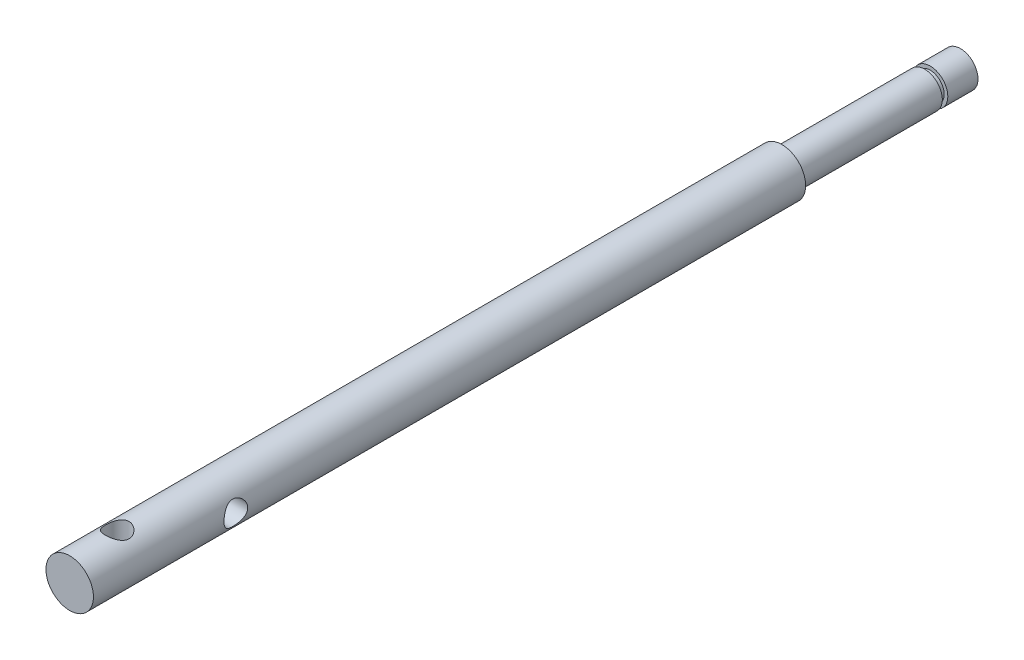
ISO-10303-21;
HEADER;
FILE_DESCRIPTION(('STEP AP214'),'2;1');
FILE_NAME('part.step','',(''),(''),'','','');
FILE_SCHEMA(('AUTOMOTIVE_DESIGN { 1 0 10303 214 1 1 1 1 }'));
ENDSEC;
DATA;
#1=APPLICATION_CONTEXT('core data for automotive mechanical design processes');
#2=APPLICATION_PROTOCOL_DEFINITION('international standard','automotive_design',2000,#1);
#3=PRODUCT_CONTEXT('',#1,'mechanical');
#4=PRODUCT('Part','Part','',(#3));
#5=PRODUCT_RELATED_PRODUCT_CATEGORY('part','',(#4));
#6=PRODUCT_DEFINITION_FORMATION('','',#4);
#7=PRODUCT_DEFINITION_CONTEXT('part definition',#1,'design');
#8=PRODUCT_DEFINITION('design','',#6,#7);
#9=PRODUCT_DEFINITION_SHAPE('','',#8);
#10=(LENGTH_UNIT() NAMED_UNIT(*) SI_UNIT(.MILLI.,.METRE.));
#11=(NAMED_UNIT(*) PLANE_ANGLE_UNIT() SI_UNIT($,.RADIAN.));
#12=(NAMED_UNIT(*) SI_UNIT($,.STERADIAN.) SOLID_ANGLE_UNIT());
#13=UNCERTAINTY_MEASURE_WITH_UNIT(LENGTH_MEASURE(1.E-05),#10,'distance_accuracy_value','');
#14=(GEOMETRIC_REPRESENTATION_CONTEXT(3) GLOBAL_UNCERTAINTY_ASSIGNED_CONTEXT((#13)) GLOBAL_UNIT_ASSIGNED_CONTEXT((#10,
#11,#12)) REPRESENTATION_CONTEXT('',''));
#15=CARTESIAN_POINT('',(0.,0.,0.));
#16=DIRECTION('',(0.,0.,1.));
#17=DIRECTION('',(1.,0.,0.));
#18=AXIS2_PLACEMENT_3D('',#15,#16,#17);
#19=CARTESIAN_POINT('',(0.,0.,23.876));
#20=DIRECTION('',(0.,0.,-1.));
#21=DIRECTION('',(-1.,0.,0.));
#22=AXIS2_PLACEMENT_3D('',#19,#20,#21);
#23=CYLINDRICAL_SURFACE('',#22,2.3495);
#24=CARTESIAN_POINT('',(0.,0.,0.));
#25=DIRECTION('',(0.,0.,1.));
#26=DIRECTION('',(1.,0.,0.));
#27=AXIS2_PLACEMENT_3D('',#24,#25,#26);
#28=CIRCLE('',#27,2.3495);
#29=CARTESIAN_POINT('',(2.3495,0.,0.));
#30=VERTEX_POINT('',#29);
#31=EDGE_CURVE('E45',#30,#30,#28,.T.);
#32=ORIENTED_EDGE('',*,*,#31,.T.);
#33=EDGE_LOOP('',(#32));
#34=FACE_BOUND('',#33,.T.);
#35=CARTESIAN_POINT('',(0.,0.,4.0386));
#36=DIRECTION('',(0.,0.,1.));
#37=DIRECTION('',(1.,0.,0.));
#38=AXIS2_PLACEMENT_3D('',#35,#36,#37);
#39=CIRCLE('',#38,2.3495);
#40=CARTESIAN_POINT('',(2.3495,0.,4.0386));
#41=VERTEX_POINT('',#40);
#42=EDGE_CURVE('E50',#41,#41,#39,.T.);
#43=ORIENTED_EDGE('',*,*,#42,.F.);
#44=EDGE_LOOP('',(#43));
#45=FACE_BOUND('',#44,.T.);
#46=ADVANCED_FACE('F34',(#34,#45),#23,.T.);
#47=CARTESIAN_POINT('',(0.,0.,0.));
#48=DIRECTION('',(0.,0.,1.));
#49=DIRECTION('',(1.,0.,0.));
#50=AXIS2_PLACEMENT_3D('',#47,#48,#49);
#51=PLANE('',#50);
#52=ORIENTED_EDGE('',*,*,#31,.F.);
#53=EDGE_LOOP('',(#52));
#54=FACE_BOUND('',#53,.T.);
#55=ADVANCED_FACE('F98',(#54),#51,.F.);
#56=CARTESIAN_POINT('',(0.,2.68096212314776,4.0386));
#57=DIRECTION('',(0.,0.,1.));
#58=DIRECTION('',(1.,0.,0.));
#59=AXIS2_PLACEMENT_3D('',#56,#57,#58);
#60=PLANE('',#59);
#61=CARTESIAN_POINT('',(0.,0.,4.0386));
#62=DIRECTION('',(0.,0.,-1.));
#63=DIRECTION('',(-1.,0.,0.));
#64=AXIS2_PLACEMENT_3D('',#61,#62,#63);
#65=CIRCLE('',#64,1.8669);
#66=CARTESIAN_POINT('',(-1.8669,0.,4.0386));
#67=VERTEX_POINT('',#66);
#68=EDGE_CURVE('E53',#67,#67,#65,.T.);
#69=ORIENTED_EDGE('',*,*,#68,.T.);
#70=EDGE_LOOP('',(#69));
#71=FACE_BOUND('',#70,.T.);
#72=ORIENTED_EDGE('',*,*,#42,.T.);
#73=EDGE_LOOP('',(#72));
#74=FACE_BOUND('',#73,.T.);
#75=ADVANCED_FACE('F103',(#71,#74),#60,.T.);
#76=CARTESIAN_POINT('',(0.,1.8669,4.7752));
#77=DIRECTION('',(0.,0.,-1.));
#78=DIRECTION('',(-1.,0.,0.));
#79=AXIS2_PLACEMENT_3D('',#76,#77,#78);
#80=PLANE('',#79);
#81=CARTESIAN_POINT('',(0.,0.,4.7752));
#82=DIRECTION('',(0.,0.,-1.));
#83=DIRECTION('',(-1.,0.,0.));
#84=AXIS2_PLACEMENT_3D('',#81,#82,#83);
#85=CIRCLE('',#84,1.8669);
#86=CARTESIAN_POINT('',(-1.8669,0.,4.7752));
#87=VERTEX_POINT('',#86);
#88=EDGE_CURVE('E127',#87,#87,#85,.T.);
#89=ORIENTED_EDGE('',*,*,#88,.F.);
#90=EDGE_LOOP('',(#89));
#91=FACE_BOUND('',#90,.T.);
#92=CARTESIAN_POINT('',(0.,0.,4.7752));
#93=DIRECTION('',(0.,0.,-1.));
#94=DIRECTION('',(-1.,0.,0.));
#95=AXIS2_PLACEMENT_3D('',#92,#93,#94);
#96=CIRCLE('',#95,2.3495);
#97=CARTESIAN_POINT('',(-2.3495,0.,4.7752));
#98=VERTEX_POINT('',#97);
#99=EDGE_CURVE('E56',#98,#98,#96,.T.);
#100=ORIENTED_EDGE('',*,*,#99,.T.);
#101=EDGE_LOOP('',(#100));
#102=FACE_BOUND('',#101,.T.);
#103=ADVANCED_FACE('F110',(#91,#102),#80,.T.);
#104=CARTESIAN_POINT('',(0.,0.,0.));
#105=DIRECTION('',(0.,0.,-1.));
#106=DIRECTION('',(-1.,0.,0.));
#107=AXIS2_PLACEMENT_3D('',#104,#105,#106);
#108=CYLINDRICAL_SURFACE('',#107,1.8669);
#109=ORIENTED_EDGE('',*,*,#68,.F.);
#110=EDGE_LOOP('',(#109));
#111=FACE_BOUND('',#110,.T.);
#112=ORIENTED_EDGE('',*,*,#88,.T.);
#113=EDGE_LOOP('',(#112));
#114=FACE_BOUND('',#113,.T.);
#115=ADVANCED_FACE('F94',(#111,#114),#108,.T.);
#116=CARTESIAN_POINT('',(0.,0.,23.876));
#117=DIRECTION('',(0.,0.,1.));
#118=DIRECTION('',(1.,0.,0.));
#119=AXIS2_PLACEMENT_3D('',#116,#117,#118);
#120=CIRCLE('',#119,2.3495);
#121=CARTESIAN_POINT('',(2.3495,0.,23.876));
#122=VERTEX_POINT('',#121);
#123=EDGE_CURVE('E10',#122,#122,#120,.T.);
#124=ORIENTED_EDGE('',*,*,#123,.F.);
#125=EDGE_LOOP('',(#124));
#126=FACE_BOUND('',#125,.T.);
#127=ORIENTED_EDGE('',*,*,#99,.F.);
#128=EDGE_LOOP('',(#127));
#129=FACE_BOUND('',#128,.T.);
#130=ADVANCED_FACE('F87',(#126,#129),#23,.T.);
#131=CARTESIAN_POINT('',(0.,0.,23.876));
#132=DIRECTION('',(0.,0.,1.));
#133=DIRECTION('',(1.,0.,0.));
#134=AXIS2_PLACEMENT_3D('',#131,#132,#133);
#135=PLANE('',#134);
#136=CARTESIAN_POINT('',(0.,0.,23.876));
#137=DIRECTION('',(0.,0.,1.));
#138=DIRECTION('',(1.,0.,0.));
#139=AXIS2_PLACEMENT_3D('',#136,#137,#138);
#140=CIRCLE('',#139,3.175);
#141=CARTESIAN_POINT('',(3.175,0.,23.876));
#142=VERTEX_POINT('',#141);
#143=EDGE_CURVE('E130',#142,#142,#140,.T.);
#144=ORIENTED_EDGE('',*,*,#143,.F.);
#145=EDGE_LOOP('',(#144));
#146=FACE_BOUND('',#145,.T.);
#147=ORIENTED_EDGE('',*,*,#123,.T.);
#148=EDGE_LOOP('',(#147));
#149=FACE_BOUND('',#148,.T.);
#150=ADVANCED_FACE('F85',(#146,#149),#135,.F.);
#151=CARTESIAN_POINT('',(0.,0.,119.126));
#152=DIRECTION('',(0.,0.,-1.));
#153=DIRECTION('',(-1.,0.,0.));
#154=AXIS2_PLACEMENT_3D('',#151,#152,#153);
#155=CYLINDRICAL_SURFACE('',#154,3.175);
#156=CARTESIAN_POINT('',(-3.175,0.,101.6635));
#157=CARTESIAN_POINT('',(-3.17499545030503,-0.0834579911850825,101.663494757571));
#158=CARTESIAN_POINT('',(-3.17167404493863,-0.167015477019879,101.65688000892));
#159=CARTESIAN_POINT('',(-3.15871472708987,-0.33166087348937,101.630713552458));
#160=CARTESIAN_POINT('',(-3.1490648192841,-0.412743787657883,101.611137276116));
#161=CARTESIAN_POINT('',(-3.12445843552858,-0.569807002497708,101.560004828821));
#162=CARTESIAN_POINT('',(-3.10952259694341,-0.64580579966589,101.528495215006));
#163=CARTESIAN_POINT('',(-3.07571420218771,-0.79132527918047,101.454631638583));
#164=CARTESIAN_POINT('',(-3.05684195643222,-0.860846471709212,101.412278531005));
#165=CARTESIAN_POINT('',(-3.01555559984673,-0.996168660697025,101.315016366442));
#166=CARTESIAN_POINT('',(-2.99299628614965,-1.06149014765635,101.259502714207));
#167=CARTESIAN_POINT('',(-2.94735202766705,-1.18233736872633,101.138797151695));
#168=CARTESIAN_POINT('',(-2.92426669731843,-1.23785563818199,101.073597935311));
#169=CARTESIAN_POINT('',(-2.87812085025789,-1.34183755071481,100.929307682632));
#170=CARTESIAN_POINT('',(-2.85520109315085,-1.38942022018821,100.849531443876));
#171=CARTESIAN_POINT('',(-2.81441491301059,-1.47029206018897,100.681841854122));
#172=CARTESIAN_POINT('',(-2.79654488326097,-1.50359144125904,100.593934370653));
#173=CARTESIAN_POINT('',(-2.76951863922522,-1.55278525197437,100.417844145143));
#174=CARTESIAN_POINT('',(-2.75990481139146,-1.56960229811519,100.329992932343));
#175=CARTESIAN_POINT('',(-2.74926250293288,-1.58817785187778,100.152233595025));
#176=CARTESIAN_POINT('',(-2.74822553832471,-1.58995124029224,100.062327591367));
#177=CARTESIAN_POINT('',(-2.75448601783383,-1.579066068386,99.8945709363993));
#178=CARTESIAN_POINT('',(-2.76080162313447,-1.56810798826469,99.8165643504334));
#179=CARTESIAN_POINT('',(-2.77933513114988,-1.53501701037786,99.6636914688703));
#180=CARTESIAN_POINT('',(-2.79155491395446,-1.5128805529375,99.5888261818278));
#181=CARTESIAN_POINT('',(-2.82078868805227,-1.45765802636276,99.442223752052));
#182=CARTESIAN_POINT('',(-2.83790772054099,-1.42432891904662,99.3706000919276));
#183=CARTESIAN_POINT('',(-2.87501654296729,-1.34785367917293,99.2336180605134));
#184=CARTESIAN_POINT('',(-2.89500762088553,-1.30470313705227,99.1682625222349));
#185=CARTESIAN_POINT('',(-2.93867138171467,-1.20342986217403,99.0369475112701));
#186=CARTESIAN_POINT('',(-2.96248947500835,-1.14410245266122,98.9719622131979));
#187=CARTESIAN_POINT('',(-3.00906851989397,-1.01529448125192,98.852457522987));
#188=CARTESIAN_POINT('',(-3.03182896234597,-0.945809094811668,98.7979431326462));
#189=CARTESIAN_POINT('',(-3.07501904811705,-0.794569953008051,98.6985490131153));
#190=CARTESIAN_POINT('',(-3.09529137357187,-0.712396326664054,98.6542342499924));
#191=CARTESIAN_POINT('',(-3.12988136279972,-0.54049011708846,98.5804209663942));
#192=CARTESIAN_POINT('',(-3.14420375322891,-0.450763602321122,98.5509106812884));
#193=CARTESIAN_POINT('',(-3.16427379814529,-0.274266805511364,98.5099702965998));
#194=CARTESIAN_POINT('',(-3.1706333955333,-0.187867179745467,98.497245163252));
#195=CARTESIAN_POINT('',(-3.17615908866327,-0.0139376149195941,98.486174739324));
#196=CARTESIAN_POINT('',(-3.17532859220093,0.0735917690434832,98.4878226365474));
#197=CARTESIAN_POINT('',(-3.16692267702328,0.240082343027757,98.5047031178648));
#198=CARTESIAN_POINT('',(-3.15987502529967,0.319181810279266,98.5188728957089));
#199=CARTESIAN_POINT('',(-3.14042696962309,0.473720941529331,98.5587279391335));
#200=CARTESIAN_POINT('',(-3.12802597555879,0.549160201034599,98.5844144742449));
#201=CARTESIAN_POINT('',(-3.09854999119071,0.696735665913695,98.6472475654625));
#202=CARTESIAN_POINT('',(-3.08135149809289,0.768715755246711,98.6847007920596));
#203=CARTESIAN_POINT('',(-3.043935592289,0.905607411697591,98.7696582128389));
#204=CARTESIAN_POINT('',(-3.02371689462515,0.970515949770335,98.8171666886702));
#205=CARTESIAN_POINT('',(-2.97986801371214,1.09818120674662,98.9262696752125));
#206=CARTESIAN_POINT('',(-2.95609779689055,1.1601006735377,98.9887893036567));
#207=CARTESIAN_POINT('',(-2.90929046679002,1.27294690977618,99.1233811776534));
#208=CARTESIAN_POINT('',(-2.88625386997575,1.32386607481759,99.1954599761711));
#209=CARTESIAN_POINT('',(-2.84243767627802,1.41558631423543,99.3515343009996));
#210=CARTESIAN_POINT('',(-2.82182140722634,1.45577797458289,99.435937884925));
#211=CARTESIAN_POINT('',(-2.7872383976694,1.52095648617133,99.6116722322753));
#212=CARTESIAN_POINT('',(-2.77326309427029,1.54596292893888,99.7029938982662));
#213=CARTESIAN_POINT('',(-2.75528882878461,1.57775542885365,99.8805949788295));
#214=CARTESIAN_POINT('',(-2.75046096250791,1.58606013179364,99.9665168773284));
#215=CARTESIAN_POINT('',(-2.74900000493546,1.58859403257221,100.138622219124));
#216=CARTESIAN_POINT('',(-2.75236336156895,1.58282933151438,100.224805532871));
#217=CARTESIAN_POINT('',(-2.76602606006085,1.55880772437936,100.386330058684));
#218=CARTESIAN_POINT('',(-2.77563412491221,1.54179319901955,100.461921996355));
#219=CARTESIAN_POINT('',(-2.79988988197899,1.49729088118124,100.609095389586));
#220=CARTESIAN_POINT('',(-2.8145391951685,1.46979971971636,100.680675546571));
#221=CARTESIAN_POINT('',(-2.84842791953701,1.40305749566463,100.823116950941));
#222=CARTESIAN_POINT('',(-2.86790959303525,1.36314043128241,100.893606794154));
#223=CARTESIAN_POINT('',(-2.90886088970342,1.27341466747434,101.027348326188));
#224=CARTESIAN_POINT('',(-2.93033154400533,1.22360082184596,101.090596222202));
#225=CARTESIAN_POINT('',(-2.97596438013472,1.10839778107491,101.216050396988));
#226=CARTESIAN_POINT('',(-3.00013660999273,1.04185152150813,101.277196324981));
#227=CARTESIAN_POINT('',(-3.0460593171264,0.898770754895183,101.387692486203));
#228=CARTESIAN_POINT('',(-3.06780848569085,0.822230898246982,101.437036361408));
#229=CARTESIAN_POINT('',(-3.10670590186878,0.660291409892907,101.522587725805));
#230=CARTESIAN_POINT('',(-3.12382053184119,0.574832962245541,101.558699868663));
#231=CARTESIAN_POINT('',(-3.15120879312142,0.398053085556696,101.615570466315));
#232=CARTESIAN_POINT('',(-3.1615018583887,0.306749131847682,101.636372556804));
#233=CARTESIAN_POINT('',(-3.17016545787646,0.178755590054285,101.653812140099));
#234=CARTESIAN_POINT('',(-3.17197367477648,0.143131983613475,101.657439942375));
#235=CARTESIAN_POINT('',(-3.17439193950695,0.0716783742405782,101.662285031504));
#236=CARTESIAN_POINT('',(-3.17500195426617,0.0358483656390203,101.663502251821));
#237=CARTESIAN_POINT('',(-3.175,0.,101.6635));
#238=B_SPLINE_CURVE_WITH_KNOTS('',3,(#156,#157,#158,#159,#160,#161,#162,#163,#164,#165,#166,
#167,#168,#169,#170,#171,#172,#173,#174,#175,#176,#177,#178,#179,#180,#181,#182,#183,#184,#185,
#186,#187,#188,#189,#190,#191,#192,#193,#194,#195,#196,#197,#198,#199,#200,#201,#202,#203,#204,
#205,#206,#207,#208,#209,#210,#211,#212,#213,#214,#215,#216,#217,#218,#219,#220,#221,#222,#223,
#224,#225,#226,#227,#228,#229,#230,#231,#232,#233,#234,#235,#236,#237),.UNSPECIFIED.,.T.,.F.,(4,
2,2,2,2,2,2,2,2,2,2,2,2,2,2,2,2,2,2,2,2,2,2,2,2,2,2,2,2,2,2,2,2,2,2,2,2,2,2,2,4),(0.,
0.250228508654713,0.500932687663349,0.750668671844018,1.00038496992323,1.26520854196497,
1.53023290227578,1.81580990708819,2.10118242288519,2.36947094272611,2.63749404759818,
2.87346568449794,3.10951251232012,3.35105756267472,3.59271127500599,3.86500594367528,
4.1374303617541,4.4225054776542,4.70735369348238,4.96860973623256,5.22974196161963,
5.47063464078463,5.71155388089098,5.95936158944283,6.20727503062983,6.47953381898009,
6.75198021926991,7.03762057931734,7.32289162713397,7.58077775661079,7.83855207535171,
8.07176964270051,8.30506226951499,8.55402875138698,8.80312503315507,9.08248822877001,
9.36200158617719,9.64349121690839,9.92417542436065,10.0316550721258,10.1391376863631),.UNSPECIFIED.);
#239=CARTESIAN_POINT('',(-3.175,0.,101.6635));
#240=VERTEX_POINT('',#239);
#241=EDGE_CURVE('E37',#240,#240,#238,.T.);
#242=ORIENTED_EDGE('',*,*,#241,.T.);
#243=EDGE_LOOP('',(#242));
#244=FACE_BOUND('',#243,.T.);
#245=CARTESIAN_POINT('',(3.175,0.,98.4885));
#246=CARTESIAN_POINT('',(3.17499545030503,-0.0834579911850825,98.4885052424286));
#247=CARTESIAN_POINT('',(3.17167404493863,-0.167015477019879,98.4951199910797));
#248=CARTESIAN_POINT('',(3.15871472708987,-0.33166087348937,98.5212864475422));
#249=CARTESIAN_POINT('',(3.1490648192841,-0.412743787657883,98.5408627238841));
#250=CARTESIAN_POINT('',(3.12445843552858,-0.569807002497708,98.5919951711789));
#251=CARTESIAN_POINT('',(3.10952259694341,-0.64580579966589,98.6235047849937));
#252=CARTESIAN_POINT('',(3.07571420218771,-0.79132527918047,98.6973683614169));
#253=CARTESIAN_POINT('',(3.05684195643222,-0.860846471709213,98.7397214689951));
#254=CARTESIAN_POINT('',(3.01555559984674,-0.996168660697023,98.8369836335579));
#255=CARTESIAN_POINT('',(2.99299628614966,-1.06149014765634,98.8924972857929));
#256=CARTESIAN_POINT('',(2.94735202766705,-1.18233736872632,99.0132028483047));
#257=CARTESIAN_POINT('',(2.92426669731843,-1.23785563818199,99.0784020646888));
#258=CARTESIAN_POINT('',(2.87812085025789,-1.34183755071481,99.2226923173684));
#259=CARTESIAN_POINT('',(2.85520109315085,-1.38942022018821,99.3024685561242));
#260=CARTESIAN_POINT('',(2.81441491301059,-1.47029206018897,99.4701581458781));
#261=CARTESIAN_POINT('',(2.79654488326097,-1.50359144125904,99.5580656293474));
#262=CARTESIAN_POINT('',(2.76951863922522,-1.55278525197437,99.7341558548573));
#263=CARTESIAN_POINT('',(2.75990481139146,-1.56960229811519,99.822007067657));
#264=CARTESIAN_POINT('',(2.74926250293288,-1.58817785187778,99.9997664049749));
#265=CARTESIAN_POINT('',(2.74822553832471,-1.58995124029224,100.089672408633));
#266=CARTESIAN_POINT('',(2.75448601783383,-1.579066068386,100.257429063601));
#267=CARTESIAN_POINT('',(2.76080162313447,-1.56810798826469,100.335435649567));
#268=CARTESIAN_POINT('',(2.77933513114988,-1.53501701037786,100.48830853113));
#269=CARTESIAN_POINT('',(2.79155491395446,-1.5128805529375,100.563173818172));
#270=CARTESIAN_POINT('',(2.82078868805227,-1.45765802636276,100.709776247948));
#271=CARTESIAN_POINT('',(2.83790772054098,-1.42432891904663,100.781399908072));
#272=CARTESIAN_POINT('',(2.87501654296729,-1.34785367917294,100.918381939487));
#273=CARTESIAN_POINT('',(2.89500762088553,-1.30470313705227,100.983737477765));
#274=CARTESIAN_POINT('',(2.93867138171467,-1.20342986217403,101.11505248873));
#275=CARTESIAN_POINT('',(2.96248947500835,-1.14410245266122,101.180037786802));
#276=CARTESIAN_POINT('',(3.00906851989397,-1.01529448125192,101.299542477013));
#277=CARTESIAN_POINT('',(3.03182896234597,-0.945809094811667,101.354056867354));
#278=CARTESIAN_POINT('',(3.07501904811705,-0.794569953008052,101.453450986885));
#279=CARTESIAN_POINT('',(3.09529137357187,-0.712396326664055,101.497765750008));
#280=CARTESIAN_POINT('',(3.12988136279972,-0.540490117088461,101.571579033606));
#281=CARTESIAN_POINT('',(3.14420375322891,-0.450763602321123,101.601089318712));
#282=CARTESIAN_POINT('',(3.16427379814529,-0.274266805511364,101.6420297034));
#283=CARTESIAN_POINT('',(3.1706333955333,-0.187867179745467,101.654754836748));
#284=CARTESIAN_POINT('',(3.17615908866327,-0.0139376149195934,101.665825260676));
#285=CARTESIAN_POINT('',(3.17532859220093,0.0735917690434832,101.664177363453));
#286=CARTESIAN_POINT('',(3.16692267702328,0.240082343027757,101.647296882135));
#287=CARTESIAN_POINT('',(3.15987502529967,0.319181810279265,101.633127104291));
#288=CARTESIAN_POINT('',(3.14042696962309,0.473720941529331,101.593272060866));
#289=CARTESIAN_POINT('',(3.12802597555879,0.549160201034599,101.567585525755));
#290=CARTESIAN_POINT('',(3.09854999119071,0.696735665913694,101.504752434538));
#291=CARTESIAN_POINT('',(3.08135149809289,0.768715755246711,101.46729920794));
#292=CARTESIAN_POINT('',(3.04393559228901,0.905607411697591,101.382341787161));
#293=CARTESIAN_POINT('',(3.02371689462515,0.970515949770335,101.33483331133));
#294=CARTESIAN_POINT('',(2.97986801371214,1.09818120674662,101.225730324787));
#295=CARTESIAN_POINT('',(2.95609779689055,1.1601006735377,101.163210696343));
#296=CARTESIAN_POINT('',(2.90929046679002,1.27294690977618,101.028618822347));
#297=CARTESIAN_POINT('',(2.88625386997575,1.32386607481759,100.956540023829));
#298=CARTESIAN_POINT('',(2.84243767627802,1.41558631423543,100.800465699));
#299=CARTESIAN_POINT('',(2.82182140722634,1.45577797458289,100.716062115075));
#300=CARTESIAN_POINT('',(2.7872383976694,1.52095648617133,100.540327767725));
#301=CARTESIAN_POINT('',(2.77326309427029,1.54596292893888,100.449006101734));
#302=CARTESIAN_POINT('',(2.75528882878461,1.57775542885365,100.271405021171));
#303=CARTESIAN_POINT('',(2.75046096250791,1.58606013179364,100.185483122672));
#304=CARTESIAN_POINT('',(2.74900000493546,1.58859403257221,100.013377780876));
#305=CARTESIAN_POINT('',(2.75236336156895,1.58282933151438,99.9271944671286));
#306=CARTESIAN_POINT('',(2.76602606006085,1.55880772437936,99.7656699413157));
#307=CARTESIAN_POINT('',(2.77563412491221,1.54179319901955,99.6900780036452));
#308=CARTESIAN_POINT('',(2.79988988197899,1.49729088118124,99.5429046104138));
#309=CARTESIAN_POINT('',(2.81453919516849,1.46979971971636,99.4713244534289));
#310=CARTESIAN_POINT('',(2.84842791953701,1.40305749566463,99.3288830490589));
#311=CARTESIAN_POINT('',(2.86790959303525,1.36314043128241,99.2583932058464));
#312=CARTESIAN_POINT('',(2.90886088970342,1.27341466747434,99.1246516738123));
#313=CARTESIAN_POINT('',(2.93033154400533,1.22360082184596,99.0614037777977));
#314=CARTESIAN_POINT('',(2.97596438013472,1.10839778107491,98.9359496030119));
#315=CARTESIAN_POINT('',(3.00013660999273,1.04185152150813,98.8748036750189));
#316=CARTESIAN_POINT('',(3.0460593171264,0.898770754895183,98.7643075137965));
#317=CARTESIAN_POINT('',(3.06780848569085,0.822230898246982,98.7149636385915));
#318=CARTESIAN_POINT('',(3.10670590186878,0.660291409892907,98.6294122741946));
#319=CARTESIAN_POINT('',(3.12382053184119,0.574832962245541,98.5933001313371));
#320=CARTESIAN_POINT('',(3.15120879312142,0.398053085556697,98.5364295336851));
#321=CARTESIAN_POINT('',(3.1615018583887,0.306749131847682,98.5156274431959));
#322=CARTESIAN_POINT('',(3.17016545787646,0.178755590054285,98.4981878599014));
#323=CARTESIAN_POINT('',(3.17197367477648,0.143131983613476,98.4945600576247));
#324=CARTESIAN_POINT('',(3.17439193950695,0.0716783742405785,98.4897149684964));
#325=CARTESIAN_POINT('',(3.17500195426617,0.0358483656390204,98.4884977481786));
#326=CARTESIAN_POINT('',(3.175,0.,98.4885));
#327=B_SPLINE_CURVE_WITH_KNOTS('',3,(#245,#246,#247,#248,#249,#250,#251,#252,#253,#254,#255,
#256,#257,#258,#259,#260,#261,#262,#263,#264,#265,#266,#267,#268,#269,#270,#271,#272,#273,#274,
#275,#276,#277,#278,#279,#280,#281,#282,#283,#284,#285,#286,#287,#288,#289,#290,#291,#292,#293,
#294,#295,#296,#297,#298,#299,#300,#301,#302,#303,#304,#305,#306,#307,#308,#309,#310,#311,#312,
#313,#314,#315,#316,#317,#318,#319,#320,#321,#322,#323,#324,#325,#326),.UNSPECIFIED.,.T.,.F.,(4,
2,2,2,2,2,2,2,2,2,2,2,2,2,2,2,2,2,2,2,2,2,2,2,2,2,2,2,2,2,2,2,2,2,2,2,2,2,2,2,4),(0.,
0.250228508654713,0.500932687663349,0.750668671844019,1.00038496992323,1.26520854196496,
1.53023290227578,1.81580990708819,2.10118242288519,2.36947094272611,2.63749404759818,
2.87346568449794,3.10951251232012,3.35105756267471,3.59271127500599,3.86500594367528,
4.1374303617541,4.4225054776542,4.70735369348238,4.96860973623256,5.22974196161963,
5.47063464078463,5.71155388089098,5.95936158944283,6.20727503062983,6.47953381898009,
6.75198021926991,7.03762057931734,7.32289162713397,7.58077775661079,7.83855207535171,
8.0717696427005,8.30506226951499,8.55402875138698,8.80312503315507,9.08248822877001,
9.36200158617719,9.64349121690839,9.92417542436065,10.0316550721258,10.1391376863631),.UNSPECIFIED.);
#328=CARTESIAN_POINT('',(3.175,0.,98.4885));
#329=VERTEX_POINT('',#328);
#330=EDGE_CURVE('E191',#329,#329,#327,.T.);
#331=ORIENTED_EDGE('',*,*,#330,.T.);
#332=EDGE_LOOP('',(#331));
#333=FACE_BOUND('',#332,.T.);
#334=CARTESIAN_POINT('',(0.,-3.175,114.3635));
#335=CARTESIAN_POINT('',(0.0834579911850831,-3.17499545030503,114.363494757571));
#336=CARTESIAN_POINT('',(0.167015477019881,-3.17167404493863,114.35688000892));
#337=CARTESIAN_POINT('',(0.331660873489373,-3.15871472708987,114.330713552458));
#338=CARTESIAN_POINT('',(0.412743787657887,-3.1490648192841,114.311137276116));
#339=CARTESIAN_POINT('',(0.569807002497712,-3.12445843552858,114.260004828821));
#340=CARTESIAN_POINT('',(0.645805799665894,-3.10952259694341,114.228495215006));
#341=CARTESIAN_POINT('',(0.791325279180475,-3.07571420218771,114.154631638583));
#342=CARTESIAN_POINT('',(0.860846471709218,-3.05684195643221,114.112278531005));
#343=CARTESIAN_POINT('',(0.99616866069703,-3.01555559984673,114.015016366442));
#344=CARTESIAN_POINT('',(1.06149014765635,-2.99299628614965,113.959502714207));
#345=CARTESIAN_POINT('',(1.18233736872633,-2.94735202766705,113.838797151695));
#346=CARTESIAN_POINT('',(1.23785563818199,-2.92426669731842,113.773597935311));
#347=CARTESIAN_POINT('',(1.34183755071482,-2.87812085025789,113.629307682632));
#348=CARTESIAN_POINT('',(1.38942022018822,-2.85520109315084,113.549531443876));
#349=CARTESIAN_POINT('',(1.47029206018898,-2.81441491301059,113.381841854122));
#350=CARTESIAN_POINT('',(1.50359144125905,-2.79654488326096,113.293934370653));
#351=CARTESIAN_POINT('',(1.55278525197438,-2.76951863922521,113.117844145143));
#352=CARTESIAN_POINT('',(1.5696022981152,-2.75990481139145,113.029992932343));
#353=CARTESIAN_POINT('',(1.58817785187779,-2.74926250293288,112.852233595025));
#354=CARTESIAN_POINT('',(1.58995124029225,-2.7482255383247,112.762327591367));
#355=CARTESIAN_POINT('',(1.57906606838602,-2.75448601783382,112.594570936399));
#356=CARTESIAN_POINT('',(1.5681079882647,-2.76080162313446,112.516564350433));
#357=CARTESIAN_POINT('',(1.53501701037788,-2.77933513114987,112.36369146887));
#358=CARTESIAN_POINT('',(1.51288055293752,-2.79155491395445,112.288826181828));
#359=CARTESIAN_POINT('',(1.45765802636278,-2.82078868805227,112.142223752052));
#360=CARTESIAN_POINT('',(1.42432891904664,-2.83790772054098,112.070600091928));
#361=CARTESIAN_POINT('',(1.34785367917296,-2.87501654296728,111.933618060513));
#362=CARTESIAN_POINT('',(1.30470313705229,-2.89500762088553,111.868262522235));
#363=CARTESIAN_POINT('',(1.20342986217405,-2.93867138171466,111.73694751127));
#364=CARTESIAN_POINT('',(1.14410245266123,-2.96248947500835,111.671962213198));
#365=CARTESIAN_POINT('',(1.01529448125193,-3.00906851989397,111.552457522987));
#366=CARTESIAN_POINT('',(0.945809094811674,-3.03182896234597,111.497943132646));
#367=CARTESIAN_POINT('',(0.794569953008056,-3.07501904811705,111.398549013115));
#368=CARTESIAN_POINT('',(0.712396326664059,-3.09529137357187,111.354234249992));
#369=CARTESIAN_POINT('',(0.540490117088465,-3.12988136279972,111.280420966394));
#370=CARTESIAN_POINT('',(0.450763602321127,-3.14420375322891,111.250910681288));
#371=CARTESIAN_POINT('',(0.274266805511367,-3.16427379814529,111.2099702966));
#372=CARTESIAN_POINT('',(0.18786717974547,-3.17063339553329,111.197245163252));
#373=CARTESIAN_POINT('',(0.0139376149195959,-3.17615908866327,111.186174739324));
#374=CARTESIAN_POINT('',(-0.0735917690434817,-3.17532859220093,111.187822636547));
#375=CARTESIAN_POINT('',(-0.240082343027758,-3.16692267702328,111.204703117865));
#376=CARTESIAN_POINT('',(-0.319181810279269,-3.15987502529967,111.218872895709));
#377=CARTESIAN_POINT('',(-0.473720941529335,-3.14042696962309,111.258727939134));
#378=CARTESIAN_POINT('',(-0.549160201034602,-3.12802597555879,111.284414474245));
#379=CARTESIAN_POINT('',(-0.696735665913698,-3.09854999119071,111.347247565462));
#380=CARTESIAN_POINT('',(-0.768715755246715,-3.08135149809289,111.38470079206));
#381=CARTESIAN_POINT('',(-0.905607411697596,-3.043935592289,111.469658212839));
#382=CARTESIAN_POINT('',(-0.970515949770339,-3.02371689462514,111.51716668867));
#383=CARTESIAN_POINT('',(-1.09818120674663,-2.97986801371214,111.626269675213));
#384=CARTESIAN_POINT('',(-1.16010067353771,-2.95609779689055,111.688789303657));
#385=CARTESIAN_POINT('',(-1.27294690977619,-2.90929046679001,111.823381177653));
#386=CARTESIAN_POINT('',(-1.3238660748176,-2.88625386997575,111.895459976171));
#387=CARTESIAN_POINT('',(-1.41558631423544,-2.84243767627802,112.051534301));
#388=CARTESIAN_POINT('',(-1.45577797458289,-2.82182140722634,112.135937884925));
#389=CARTESIAN_POINT('',(-1.52095648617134,-2.78723839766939,112.311672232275));
#390=CARTESIAN_POINT('',(-1.54596292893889,-2.77326309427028,112.402993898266));
#391=CARTESIAN_POINT('',(-1.57775542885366,-2.75528882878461,112.580594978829));
#392=CARTESIAN_POINT('',(-1.58606013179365,-2.75046096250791,112.666516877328));
#393=CARTESIAN_POINT('',(-1.58859403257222,-2.74900000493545,112.838622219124));
#394=CARTESIAN_POINT('',(-1.5828293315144,-2.75236336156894,112.924805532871));
#395=CARTESIAN_POINT('',(-1.55880772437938,-2.76602606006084,113.086330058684));
#396=CARTESIAN_POINT('',(-1.54179319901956,-2.7756341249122,113.161921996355));
#397=CARTESIAN_POINT('',(-1.49729088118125,-2.79988988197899,113.309095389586));
#398=CARTESIAN_POINT('',(-1.46979971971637,-2.81453919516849,113.380675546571));
#399=CARTESIAN_POINT('',(-1.40305749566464,-2.848427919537,113.523116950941));
#400=CARTESIAN_POINT('',(-1.36314043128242,-2.86790959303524,113.593606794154));
#401=CARTESIAN_POINT('',(-1.27341466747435,-2.90886088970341,113.727348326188));
#402=CARTESIAN_POINT('',(-1.22360082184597,-2.93033154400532,113.790596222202));
#403=CARTESIAN_POINT('',(-1.10839778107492,-2.97596438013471,113.916050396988));
#404=CARTESIAN_POINT('',(-1.04185152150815,-3.00013660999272,113.977196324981));
#405=CARTESIAN_POINT('',(-0.898770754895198,-3.0460593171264,114.087692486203));
#406=CARTESIAN_POINT('',(-0.822230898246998,-3.06780848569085,114.137036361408));
#407=CARTESIAN_POINT('',(-0.660291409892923,-3.10670590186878,114.222587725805));
#408=CARTESIAN_POINT('',(-0.574832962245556,-3.12382053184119,114.258699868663));
#409=CARTESIAN_POINT('',(-0.398053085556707,-3.15120879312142,114.315570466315));
#410=CARTESIAN_POINT('',(-0.30674913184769,-3.1615018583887,114.336372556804));
#411=CARTESIAN_POINT('',(-0.17875559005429,-3.17016545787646,114.353812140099));
#412=CARTESIAN_POINT('',(-0.143131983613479,-3.17197367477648,114.357439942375));
#413=CARTESIAN_POINT('',(-0.0716783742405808,-3.17439193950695,114.362285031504));
#414=CARTESIAN_POINT('',(-0.0358483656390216,-3.17500195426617,114.363502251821));
#415=CARTESIAN_POINT('',(0.,-3.175,114.3635));
#416=B_SPLINE_CURVE_WITH_KNOTS('',3,(#334,#335,#336,#337,#338,#339,#340,#341,#342,#343,#344,
#345,#346,#347,#348,#349,#350,#351,#352,#353,#354,#355,#356,#357,#358,#359,#360,#361,#362,#363,
#364,#365,#366,#367,#368,#369,#370,#371,#372,#373,#374,#375,#376,#377,#378,#379,#380,#381,#382,
#383,#384,#385,#386,#387,#388,#389,#390,#391,#392,#393,#394,#395,#396,#397,#398,#399,#400,#401,
#402,#403,#404,#405,#406,#407,#408,#409,#410,#411,#412,#413,#414,#415),.UNSPECIFIED.,.T.,.F.,(4,
2,2,2,2,2,2,2,2,2,2,2,2,2,2,2,2,2,2,2,2,2,2,2,2,2,2,2,2,2,2,2,2,2,2,2,2,2,2,2,4),(0.,
0.250228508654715,0.500932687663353,0.750668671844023,1.00038496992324,1.26520854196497,
1.53023290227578,1.8158099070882,2.1011824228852,2.36947094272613,2.6374940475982,
2.87346568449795,3.10951251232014,3.35105756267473,3.59271127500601,3.86500594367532,
4.13743036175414,4.42250547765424,4.70735369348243,4.9686097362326,5.22974196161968,
5.47063464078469,5.71155388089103,5.95936158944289,6.20727503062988,6.47953381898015,
6.75198021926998,7.0376205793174,7.32289162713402,7.58077775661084,7.83855207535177,
8.07176964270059,8.30506226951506,8.55402875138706,8.80312503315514,9.08248822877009,
9.36200158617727,9.64349121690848,9.92417542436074,10.0316550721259,10.1391376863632),.UNSPECIFIED.);
#417=CARTESIAN_POINT('',(0.,-3.175,114.3635));
#418=VERTEX_POINT('',#417);
#419=EDGE_CURVE('E67',#418,#418,#416,.T.);
#420=ORIENTED_EDGE('',*,*,#419,.T.);
#421=EDGE_LOOP('',(#420));
#422=FACE_BOUND('',#421,.T.);
#423=CARTESIAN_POINT('',(0.,3.175,114.3635));
#424=CARTESIAN_POINT('',(-0.0834579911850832,3.17499545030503,114.363494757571));
#425=CARTESIAN_POINT('',(-0.167015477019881,3.17167404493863,114.35688000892));
#426=CARTESIAN_POINT('',(-0.331660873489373,3.15871472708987,114.330713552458));
#427=CARTESIAN_POINT('',(-0.412743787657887,3.1490648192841,114.311137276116));
#428=CARTESIAN_POINT('',(-0.569807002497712,3.12445843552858,114.260004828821));
#429=CARTESIAN_POINT('',(-0.645805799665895,3.10952259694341,114.228495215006));
#430=CARTESIAN_POINT('',(-0.791325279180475,3.07571420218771,114.154631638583));
#431=CARTESIAN_POINT('',(-0.860846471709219,3.05684195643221,114.112278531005));
#432=CARTESIAN_POINT('',(-0.99616866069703,3.01555559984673,114.015016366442));
#433=CARTESIAN_POINT('',(-1.06149014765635,2.99299628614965,113.959502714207));
#434=CARTESIAN_POINT('',(-1.18233736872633,2.94735202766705,113.838797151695));
#435=CARTESIAN_POINT('',(-1.23785563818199,2.92426669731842,113.773597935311));
#436=CARTESIAN_POINT('',(-1.34183755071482,2.87812085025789,113.629307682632));
#437=CARTESIAN_POINT('',(-1.38942022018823,2.85520109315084,113.549531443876));
#438=CARTESIAN_POINT('',(-1.47029206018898,2.81441491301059,113.381841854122));
#439=CARTESIAN_POINT('',(-1.50359144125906,2.79654488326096,113.293934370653));
#440=CARTESIAN_POINT('',(-1.55278525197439,2.76951863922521,113.117844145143));
#441=CARTESIAN_POINT('',(-1.5696022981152,2.75990481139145,113.029992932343));
#442=CARTESIAN_POINT('',(-1.58817785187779,2.74926250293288,112.852233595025));
#443=CARTESIAN_POINT('',(-1.58995124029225,2.7482255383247,112.762327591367));
#444=CARTESIAN_POINT('',(-1.57906606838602,2.75448601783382,112.594570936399));
#445=CARTESIAN_POINT('',(-1.5681079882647,2.76080162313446,112.516564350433));
#446=CARTESIAN_POINT('',(-1.53501701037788,2.77933513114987,112.36369146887));
#447=CARTESIAN_POINT('',(-1.51288055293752,2.79155491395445,112.288826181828));
#448=CARTESIAN_POINT('',(-1.45765802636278,2.82078868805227,112.142223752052));
#449=CARTESIAN_POINT('',(-1.42432891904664,2.83790772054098,112.070600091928));
#450=CARTESIAN_POINT('',(-1.34785367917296,2.87501654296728,111.933618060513));
#451=CARTESIAN_POINT('',(-1.30470313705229,2.89500762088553,111.868262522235));
#452=CARTESIAN_POINT('',(-1.20342986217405,2.93867138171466,111.73694751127));
#453=CARTESIAN_POINT('',(-1.14410245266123,2.96248947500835,111.671962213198));
#454=CARTESIAN_POINT('',(-1.01529448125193,3.00906851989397,111.552457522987));
#455=CARTESIAN_POINT('',(-0.945809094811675,3.03182896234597,111.497943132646));
#456=CARTESIAN_POINT('',(-0.794569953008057,3.07501904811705,111.398549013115));
#457=CARTESIAN_POINT('',(-0.71239632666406,3.09529137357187,111.354234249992));
#458=CARTESIAN_POINT('',(-0.540490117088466,3.12988136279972,111.280420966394));
#459=CARTESIAN_POINT('',(-0.450763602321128,3.14420375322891,111.250910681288));
#460=CARTESIAN_POINT('',(-0.274266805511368,3.16427379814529,111.2099702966));
#461=CARTESIAN_POINT('',(-0.187867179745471,3.1706333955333,111.197245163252));
#462=CARTESIAN_POINT('',(-0.0139376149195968,3.17615908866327,111.186174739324));
#463=CARTESIAN_POINT('',(0.0735917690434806,3.17532859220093,111.187822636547));
#464=CARTESIAN_POINT('',(0.240082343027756,3.16692267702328,111.204703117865));
#465=CARTESIAN_POINT('',(0.319181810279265,3.15987502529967,111.218872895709));
#466=CARTESIAN_POINT('',(0.473720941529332,3.14042696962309,111.258727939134));
#467=CARTESIAN_POINT('',(0.5491602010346,3.12802597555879,111.284414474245));
#468=CARTESIAN_POINT('',(0.696735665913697,3.09854999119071,111.347247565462));
#469=CARTESIAN_POINT('',(0.768715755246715,3.08135149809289,111.38470079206));
#470=CARTESIAN_POINT('',(0.905607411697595,3.043935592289,111.469658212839));
#471=CARTESIAN_POINT('',(0.970515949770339,3.02371689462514,111.51716668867));
#472=CARTESIAN_POINT('',(1.09818120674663,2.97986801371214,111.626269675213));
#473=CARTESIAN_POINT('',(1.16010067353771,2.95609779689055,111.688789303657));
#474=CARTESIAN_POINT('',(1.27294690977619,2.90929046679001,111.823381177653));
#475=CARTESIAN_POINT('',(1.3238660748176,2.88625386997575,111.895459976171));
#476=CARTESIAN_POINT('',(1.41558631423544,2.84243767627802,112.051534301));
#477=CARTESIAN_POINT('',(1.45577797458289,2.82182140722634,112.135937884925));
#478=CARTESIAN_POINT('',(1.52095648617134,2.78723839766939,112.311672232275));
#479=CARTESIAN_POINT('',(1.54596292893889,2.77326309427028,112.402993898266));
#480=CARTESIAN_POINT('',(1.57775542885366,2.75528882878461,112.580594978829));
#481=CARTESIAN_POINT('',(1.58606013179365,2.75046096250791,112.666516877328));
#482=CARTESIAN_POINT('',(1.58859403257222,2.74900000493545,112.838622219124));
#483=CARTESIAN_POINT('',(1.5828293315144,2.75236336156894,112.924805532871));
#484=CARTESIAN_POINT('',(1.55880772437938,2.76602606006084,113.086330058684));
#485=CARTESIAN_POINT('',(1.54179319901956,2.7756341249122,113.161921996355));
#486=CARTESIAN_POINT('',(1.49729088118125,2.79988988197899,113.309095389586));
#487=CARTESIAN_POINT('',(1.46979971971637,2.81453919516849,113.380675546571));
#488=CARTESIAN_POINT('',(1.40305749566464,2.848427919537,113.523116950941));
#489=CARTESIAN_POINT('',(1.36314043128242,2.86790959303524,113.593606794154));
#490=CARTESIAN_POINT('',(1.27341466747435,2.90886088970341,113.727348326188));
#491=CARTESIAN_POINT('',(1.22360082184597,2.93033154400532,113.790596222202));
#492=CARTESIAN_POINT('',(1.10839778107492,2.97596438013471,113.916050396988));
#493=CARTESIAN_POINT('',(1.04185152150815,3.00013660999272,113.977196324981));
#494=CARTESIAN_POINT('',(0.898770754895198,3.0460593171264,114.087692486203));
#495=CARTESIAN_POINT('',(0.822230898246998,3.06780848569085,114.137036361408));
#496=CARTESIAN_POINT('',(0.660291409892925,3.10670590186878,114.222587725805));
#497=CARTESIAN_POINT('',(0.57483296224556,3.12382053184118,114.258699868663));
#498=CARTESIAN_POINT('',(0.398053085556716,3.15120879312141,114.315570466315));
#499=CARTESIAN_POINT('',(0.306749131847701,3.1615018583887,114.336372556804));
#500=CARTESIAN_POINT('',(0.1787555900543,3.17016545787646,114.353812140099));
#501=CARTESIAN_POINT('',(0.143131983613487,3.17197367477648,114.357439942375));
#502=CARTESIAN_POINT('',(0.071678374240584,3.17439193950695,114.362285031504));
#503=CARTESIAN_POINT('',(0.0358483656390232,3.17500195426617,114.363502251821));
#504=CARTESIAN_POINT('',(0.,3.175,114.3635));
#505=B_SPLINE_CURVE_WITH_KNOTS('',3,(#423,#424,#425,#426,#427,#428,#429,#430,#431,#432,#433,
#434,#435,#436,#437,#438,#439,#440,#441,#442,#443,#444,#445,#446,#447,#448,#449,#450,#451,#452,
#453,#454,#455,#456,#457,#458,#459,#460,#461,#462,#463,#464,#465,#466,#467,#468,#469,#470,#471,
#472,#473,#474,#475,#476,#477,#478,#479,#480,#481,#482,#483,#484,#485,#486,#487,#488,#489,#490,
#491,#492,#493,#494,#495,#496,#497,#498,#499,#500,#501,#502,#503,#504),.UNSPECIFIED.,.T.,.F.,(4,
2,2,2,2,2,2,2,2,2,2,2,2,2,2,2,2,2,2,2,2,2,2,2,2,2,2,2,2,2,2,2,2,2,2,2,2,2,2,2,4),(0.,
0.250228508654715,0.500932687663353,0.750668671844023,1.00038496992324,1.26520854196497,
1.53023290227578,1.81580990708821,2.10118242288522,2.36947094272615,2.6374940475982,
2.87346568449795,3.10951251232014,3.35105756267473,3.59271127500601,3.86500594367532,
4.13743036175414,4.42250547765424,4.70735369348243,4.9686097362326,5.22974196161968,
5.47063464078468,5.71155388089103,5.95936158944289,6.20727503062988,6.47953381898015,
6.75198021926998,7.0376205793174,7.32289162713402,7.58077775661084,7.83855207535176,
8.07176964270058,8.30506226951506,8.55402875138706,8.80312503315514,9.08248822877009,
9.36200158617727,9.64349121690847,9.92417542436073,10.0316550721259,10.1391376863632),.UNSPECIFIED.);
#506=CARTESIAN_POINT('',(0.,3.175,114.3635));
#507=VERTEX_POINT('',#506);
#508=EDGE_CURVE('E61',#507,#507,#505,.T.);
#509=ORIENTED_EDGE('',*,*,#508,.T.);
#510=EDGE_LOOP('',(#509));
#511=FACE_BOUND('',#510,.T.);
#512=CARTESIAN_POINT('',(0.,0.,119.126));
#513=DIRECTION('',(0.,0.,1.));
#514=DIRECTION('',(1.,0.,0.));
#515=AXIS2_PLACEMENT_3D('',#512,#513,#514);
#516=CIRCLE('',#515,3.175);
#517=CARTESIAN_POINT('',(3.175,0.,119.126));
#518=VERTEX_POINT('',#517);
#519=EDGE_CURVE('E128',#518,#518,#516,.T.);
#520=ORIENTED_EDGE('',*,*,#519,.F.);
#521=EDGE_LOOP('',(#520));
#522=FACE_BOUND('',#521,.T.);
#523=ORIENTED_EDGE('',*,*,#143,.T.);
#524=EDGE_LOOP('',(#523));
#525=FACE_BOUND('',#524,.T.);
#526=ADVANCED_FACE('F70',(#244,#333,#422,#511,#522,#525),#155,.T.);
#527=CARTESIAN_POINT('',(0.,0.,119.126));
#528=DIRECTION('',(0.,0.,1.));
#529=DIRECTION('',(1.,0.,0.));
#530=AXIS2_PLACEMENT_3D('',#527,#528,#529);
#531=PLANE('',#530);
#532=ORIENTED_EDGE('',*,*,#519,.T.);
#533=EDGE_LOOP('',(#532));
#534=FACE_BOUND('',#533,.T.);
#535=ADVANCED_FACE('F79',(#534),#531,.T.);
#536=CARTESIAN_POINT('',(0.,-3.81,112.776));
#537=DIRECTION('',(0.,1.,0.));
#538=DIRECTION('',(0.,0.,1.));
#539=AXIS2_PLACEMENT_3D('',#536,#537,#538);
#540=CYLINDRICAL_SURFACE('',#539,1.5875);
#541=ORIENTED_EDGE('',*,*,#508,.F.);
#542=EDGE_LOOP('',(#541));
#543=FACE_BOUND('',#542,.T.);
#544=ORIENTED_EDGE('',*,*,#419,.F.);
#545=EDGE_LOOP('',(#544));
#546=FACE_BOUND('',#545,.T.);
#547=ADVANCED_FACE('F74',(#543,#546),#540,.F.);
#548=CARTESIAN_POINT('',(-3.81,0.,100.076));
#549=DIRECTION('',(1.,0.,0.));
#550=DIRECTION('',(0.,0.,-1.));
#551=AXIS2_PLACEMENT_3D('',#548,#549,#550);
#552=CYLINDRICAL_SURFACE('',#551,1.58749999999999);
#553=ORIENTED_EDGE('',*,*,#330,.F.);
#554=EDGE_LOOP('',(#553));
#555=FACE_BOUND('',#554,.T.);
#556=ORIENTED_EDGE('',*,*,#241,.F.);
#557=EDGE_LOOP('',(#556));
#558=FACE_BOUND('',#557,.T.);
#559=ADVANCED_FACE('F78',(#555,#558),#552,.F.);
#560=CLOSED_SHELL('',(#46,#55,#75,#103,#115,#130,#150,#526,#535,#547,#559));
#561=MANIFOLD_SOLID_BREP('B2',#560);
#562=ADVANCED_BREP_SHAPE_REPRESENTATION('',(#18,#561),#14);
#563=SHAPE_DEFINITION_REPRESENTATION(#9,#562);
ENDSEC;
END-ISO-10303-21;
